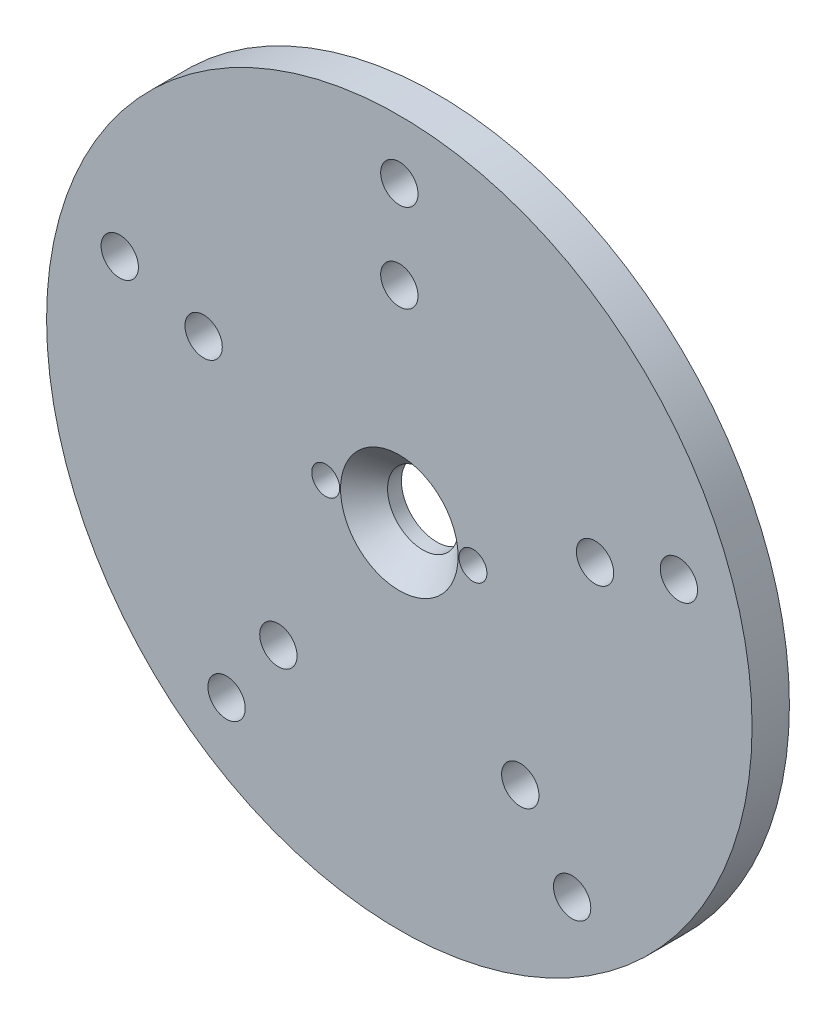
from build123d import *

# Parameters (mm, degrees)
CROQUIS1_R            = 60
CROQUIS1_R_2          = 6
CROQUIS1_R_3          = 2.375
EXTRUIR1_DEPTH        = 6.35
CHAFL_N1_SIZE         = 4
CORTAR_EXTRUIR1_REACH = 87.09
CROQUIS4_R            = 3.175
MATRIZC1_COUNT        = 5


with BuildPart() as part:
    # Croquis1 → Extruir1 (new body)
    with BuildSketch(Plane.XY):
        Circle(CROQUIS1_R)
        Circle(CROQUIS1_R_2, mode=Mode.SUBTRACT)
        with Locations((-12.525, 0)):
            Circle(CROQUIS1_R_3, mode=Mode.SUBTRACT)
        with Locations((12.525, 0)):
            Circle(CROQUIS1_R_3, mode=Mode.SUBTRACT)
    extrude(amount=EXTRUIR1_DEPTH)

    # Chafl_n1
    chafl_n1_edges = [part.edges().sort_by_distance(p)[0] for p in [
        (-6, 0, 6.35),
    ]]
    chamfer(chafl_n1_edges, length=CHAFL_N1_SIZE)

    # Croquis4 → Cortar-Extruir1 (cut, up to next)
    with BuildSketch(Plane.XY.offset(6.35), mode=Mode.PRIVATE) as cortar_extruir1_sk1:
        with Locations((0, 50)):
            Circle(CROQUIS4_R)
    cortar_extruir1_tool1 = extrude(cortar_extruir1_sk1.sketch, amount=-CORTAR_EXTRUIR1_REACH, mode=Mode.PRIVATE) & part.part
    # Croquis4 → Cortar-Extruir1 (cut, up to next)
    with BuildSketch(Plane.XY.offset(6.35), mode=Mode.PRIVATE) as cortar_extruir1_sk2:
        with Locations((0, 35)):
            Circle(CROQUIS4_R)
    cortar_extruir1_tool2 = extrude(cortar_extruir1_sk2.sketch, amount=-CORTAR_EXTRUIR1_REACH, mode=Mode.PRIVATE) & part.part
    cortar_extruir1_1 = cortar_extruir1_tool1.solids().sort_by_distance((0, 50, 6.35))[0]
    add(cortar_extruir1_1, mode=Mode.SUBTRACT)
    cortar_extruir1_2 = cortar_extruir1_tool2.solids().sort_by_distance((0, 35, 6.35))[0]
    add(cortar_extruir1_2, mode=Mode.SUBTRACT)
    cortar_extruir1 = cortar_extruir1_1 + cortar_extruir1_2  # Cortar-Extruir1 as one shape, for the pattern or mirror that repeats it

    # MatrizC1: Cortar-Extruir1 ×5 about axis
    matrizc1_axis = Axis((0, 0, 0), (0, 0, 1))
    for i in range(1, MATRIZC1_COUNT):
        add(cortar_extruir1.rotate(matrizc1_axis, i * 360 / MATRIZC1_COUNT), mode=Mode.SUBTRACT)


solid = part.part
